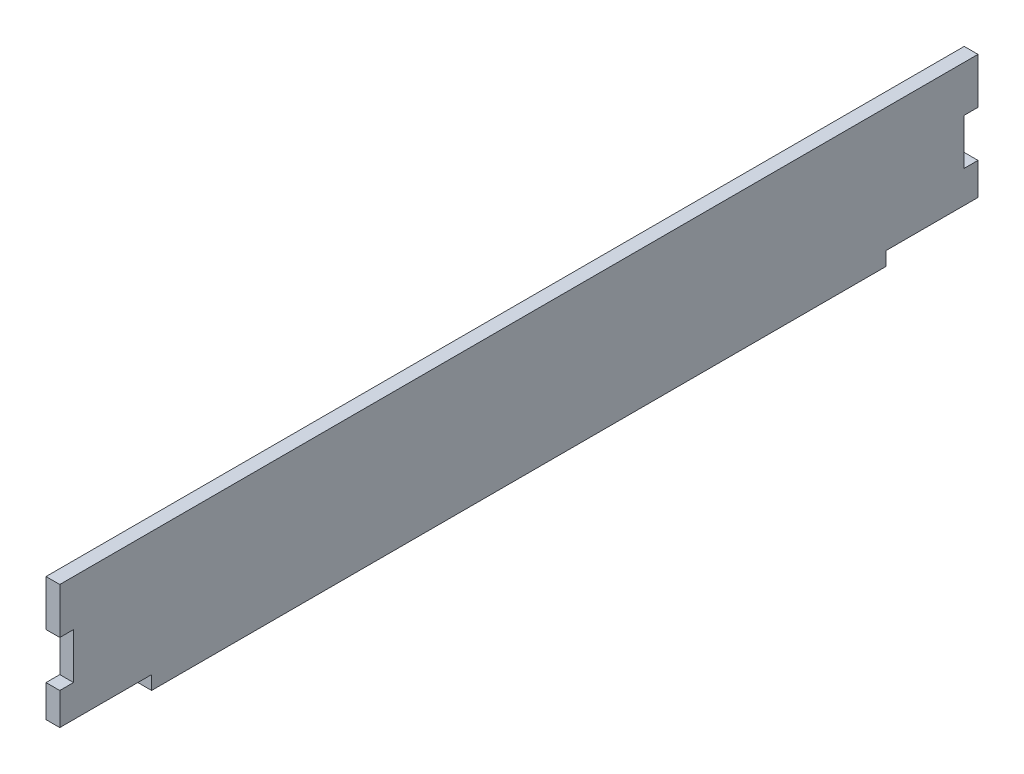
from build123d import *

# Parameters (mm, degrees)
BOSS_EXTRUDE1_DEPTH = 3


with BuildPart() as part:
    # Sketch1 → Boss-Extrude1 (new body)
    with BuildSketch(Plane(origin=(0, 0, 0), x_dir=(0, 0, -1), z_dir=(1, 0, 0))):
        Polygon((75.890549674, 14.403627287), (-124.109450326, 14.403627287), (-124.109450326, 4.403627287), (-121.109450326, 4.403627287), (-121.109450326, -5.596372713), (-124.109450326, -5.596372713), (-124.109450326, -12.596372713), (-104.109450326, -12.596372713), (-104.109450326, -15.596372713), (55.890549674, -15.596372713), (55.890549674, -12.596372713), (75.890549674, -12.596372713), (75.890549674, -5.596372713), (72.890549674, -5.596372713), (72.890549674, 4.403627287), (75.890549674, 4.403627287), align=None)
    extrude(amount=BOSS_EXTRUDE1_DEPTH)


solid = part.part
